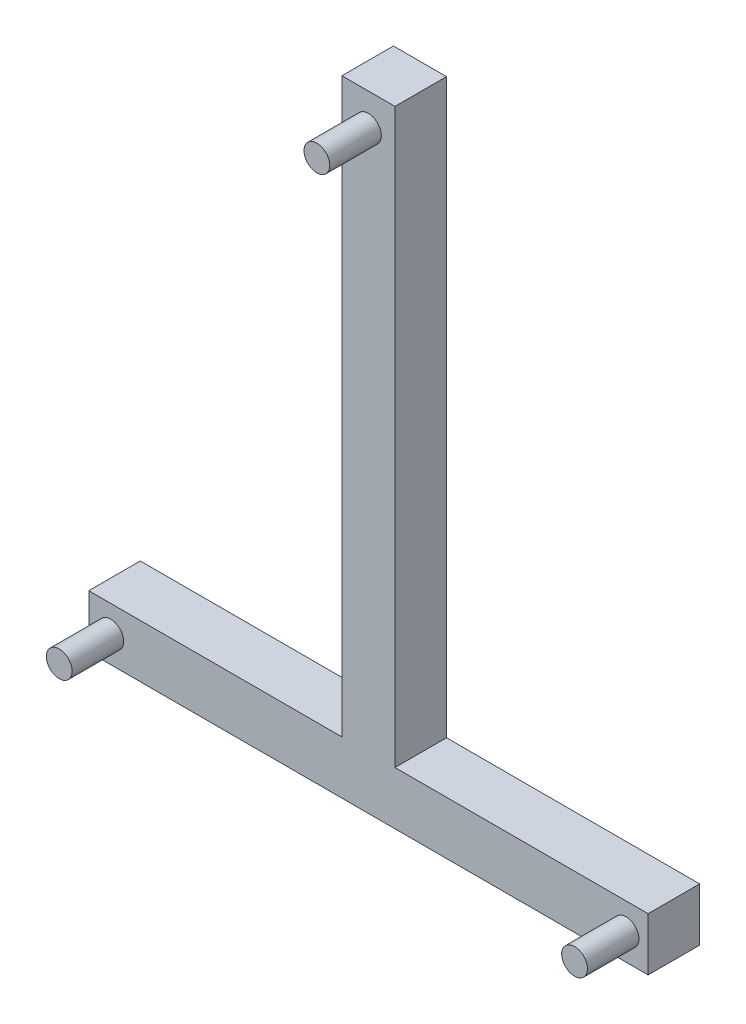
ISO-10303-21;
HEADER;
FILE_DESCRIPTION(('STEP AP214'),'2;1');
FILE_NAME('part.step','',(''),(''),'','','');
FILE_SCHEMA(('AUTOMOTIVE_DESIGN { 1 0 10303 214 1 1 1 1 }'));
ENDSEC;
DATA;
#1=APPLICATION_CONTEXT('core data for automotive mechanical design processes');
#2=APPLICATION_PROTOCOL_DEFINITION('international standard','automotive_design',2000,#1);
#3=PRODUCT_CONTEXT('',#1,'mechanical');
#4=PRODUCT('Part','Part','',(#3));
#5=PRODUCT_RELATED_PRODUCT_CATEGORY('part','',(#4));
#6=PRODUCT_DEFINITION_FORMATION('','',#4);
#7=PRODUCT_DEFINITION_CONTEXT('part definition',#1,'design');
#8=PRODUCT_DEFINITION('design','',#6,#7);
#9=PRODUCT_DEFINITION_SHAPE('','',#8);
#10=(LENGTH_UNIT() NAMED_UNIT(*) SI_UNIT(.MILLI.,.METRE.));
#11=(NAMED_UNIT(*) PLANE_ANGLE_UNIT() SI_UNIT($,.RADIAN.));
#12=(NAMED_UNIT(*) SI_UNIT($,.STERADIAN.) SOLID_ANGLE_UNIT());
#13=UNCERTAINTY_MEASURE_WITH_UNIT(LENGTH_MEASURE(1.E-05),#10,'distance_accuracy_value','');
#14=(GEOMETRIC_REPRESENTATION_CONTEXT(3) GLOBAL_UNCERTAINTY_ASSIGNED_CONTEXT((#13)) GLOBAL_UNIT_ASSIGNED_CONTEXT((#10,
#11,#12)) REPRESENTATION_CONTEXT('',''));
#15=CARTESIAN_POINT('',(0.,0.,0.));
#16=DIRECTION('',(0.,0.,1.));
#17=DIRECTION('',(1.,0.,0.));
#18=AXIS2_PLACEMENT_3D('',#15,#16,#17);
#19=CARTESIAN_POINT('',(13.0781386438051,13.0781386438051,-25.4));
#20=DIRECTION('',(0.,1.,0.));
#21=DIRECTION('',(0.,0.,1.));
#22=AXIS2_PLACEMENT_3D('',#19,#20,#21);
#23=PLANE('',#22);
#24=DIRECTION('',(-1.,0.,0.));
#25=VECTOR('',#24,1.);
#26=CARTESIAN_POINT('',(13.0781386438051,13.0781386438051,0.));
#27=LINE('',#26,#25);
#28=CARTESIAN_POINT('',(137.84334742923,13.0781386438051,0.));
#29=VERTEX_POINT('',#28);
#30=CARTESIAN_POINT('',(13.0781386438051,13.0781386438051,0.));
#31=VERTEX_POINT('',#30);
#32=EDGE_CURVE('E132',#29,#31,#27,.T.);
#33=ORIENTED_EDGE('',*,*,#32,.F.);
#34=DIRECTION('',(0.,0.,1.));
#35=VECTOR('',#34,1.);
#36=CARTESIAN_POINT('',(137.84334742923,13.0781386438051,-25.4));
#37=LINE('',#36,#35);
#38=CARTESIAN_POINT('',(137.84334742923,13.0781386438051,-25.4));
#39=VERTEX_POINT('',#38);
#40=EDGE_CURVE('E11',#39,#29,#37,.T.);
#41=ORIENTED_EDGE('',*,*,#40,.F.);
#42=DIRECTION('',(-1.,0.,0.));
#43=VECTOR('',#42,1.);
#44=CARTESIAN_POINT('',(13.0781386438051,13.0781386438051,-25.4));
#45=LINE('',#44,#43);
#46=CARTESIAN_POINT('',(13.0781386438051,13.0781386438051,-25.4));
#47=VERTEX_POINT('',#46);
#48=EDGE_CURVE('E153',#39,#47,#45,.T.);
#49=ORIENTED_EDGE('',*,*,#48,.T.);
#50=DIRECTION('',(0.,0.,1.));
#51=VECTOR('',#50,1.);
#52=CARTESIAN_POINT('',(13.0781386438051,13.0781386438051,-25.4));
#53=LINE('',#52,#51);
#54=EDGE_CURVE('E38',#47,#31,#53,.T.);
#55=ORIENTED_EDGE('',*,*,#54,.T.);
#56=EDGE_LOOP('',(#33,#41,#49,#55));
#57=FACE_BOUND('',#56,.T.);
#58=ADVANCED_FACE('F35',(#57),#23,.T.);
#59=CARTESIAN_POINT('',(137.84334742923,-13.0781386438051,-25.4));
#60=DIRECTION('',(1.,0.,0.));
#61=DIRECTION('',(0.,0.,-1.));
#62=AXIS2_PLACEMENT_3D('',#59,#60,#61);
#63=PLANE('',#62);
#64=DIRECTION('',(0.,1.,0.));
#65=VECTOR('',#64,1.);
#66=CARTESIAN_POINT('',(137.84334742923,-13.0781386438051,0.));
#67=LINE('',#66,#65);
#68=CARTESIAN_POINT('',(137.84334742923,-13.0781386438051,0.));
#69=VERTEX_POINT('',#68);
#70=EDGE_CURVE('E151',#69,#29,#67,.T.);
#71=ORIENTED_EDGE('',*,*,#70,.F.);
#72=DIRECTION('',(0.,0.,1.));
#73=VECTOR('',#72,1.);
#74=CARTESIAN_POINT('',(137.84334742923,-13.0781386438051,-25.4));
#75=LINE('',#74,#73);
#76=CARTESIAN_POINT('',(137.84334742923,-13.0781386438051,-25.4));
#77=VERTEX_POINT('',#76);
#78=EDGE_CURVE('E44',#77,#69,#75,.T.);
#79=ORIENTED_EDGE('',*,*,#78,.F.);
#80=DIRECTION('',(0.,1.,0.));
#81=VECTOR('',#80,1.);
#82=CARTESIAN_POINT('',(137.84334742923,-13.0781386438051,-25.4));
#83=LINE('',#82,#81);
#84=EDGE_CURVE('E122',#77,#39,#83,.T.);
#85=ORIENTED_EDGE('',*,*,#84,.T.);
#86=ORIENTED_EDGE('',*,*,#40,.T.);
#87=EDGE_LOOP('',(#71,#79,#85,#86));
#88=FACE_BOUND('',#87,.T.);
#89=ADVANCED_FACE('F165',(#88),#63,.T.);
#90=CARTESIAN_POINT('',(-137.84334742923,-13.0781386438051,-25.4));
#91=DIRECTION('',(0.,-1.,0.));
#92=DIRECTION('',(0.,0.,-1.));
#93=AXIS2_PLACEMENT_3D('',#90,#91,#92);
#94=PLANE('',#93);
#95=DIRECTION('',(1.,0.,0.));
#96=VECTOR('',#95,1.);
#97=CARTESIAN_POINT('',(-137.84334742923,-13.0781386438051,0.));
#98=LINE('',#97,#96);
#99=CARTESIAN_POINT('',(-137.84334742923,-13.0781386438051,0.));
#100=VERTEX_POINT('',#99);
#101=EDGE_CURVE('E109',#100,#69,#98,.T.);
#102=ORIENTED_EDGE('',*,*,#101,.F.);
#103=DIRECTION('',(0.,0.,1.));
#104=VECTOR('',#103,1.);
#105=CARTESIAN_POINT('',(-137.84334742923,-13.0781386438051,-25.4));
#106=LINE('',#105,#104);
#107=CARTESIAN_POINT('',(-137.84334742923,-13.0781386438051,-25.4));
#108=VERTEX_POINT('',#107);
#109=EDGE_CURVE('E104',#108,#100,#106,.T.);
#110=ORIENTED_EDGE('',*,*,#109,.F.);
#111=DIRECTION('',(1.,0.,0.));
#112=VECTOR('',#111,1.);
#113=CARTESIAN_POINT('',(-137.84334742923,-13.0781386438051,-25.4));
#114=LINE('',#113,#112);
#115=EDGE_CURVE('E107',#108,#77,#114,.T.);
#116=ORIENTED_EDGE('',*,*,#115,.T.);
#117=ORIENTED_EDGE('',*,*,#78,.T.);
#118=EDGE_LOOP('',(#102,#110,#116,#117));
#119=FACE_BOUND('',#118,.T.);
#120=ADVANCED_FACE('F106',(#119),#94,.T.);
#121=CARTESIAN_POINT('',(-137.84334742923,-13.0781386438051,-25.4));
#122=DIRECTION('',(-1.,0.,0.));
#123=DIRECTION('',(0.,0.,1.));
#124=AXIS2_PLACEMENT_3D('',#121,#122,#123);
#125=PLANE('',#124);
#126=DIRECTION('',(0.,-1.,0.));
#127=VECTOR('',#126,1.);
#128=CARTESIAN_POINT('',(-137.84334742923,-13.0781386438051,0.));
#129=LINE('',#128,#127);
#130=CARTESIAN_POINT('',(-137.84334742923,13.0781386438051,0.));
#131=VERTEX_POINT('',#130);
#132=EDGE_CURVE('E148',#131,#100,#129,.T.);
#133=ORIENTED_EDGE('',*,*,#132,.F.);
#134=DIRECTION('',(0.,0.,1.));
#135=VECTOR('',#134,1.);
#136=CARTESIAN_POINT('',(-137.84334742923,13.0781386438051,-25.4));
#137=LINE('',#136,#135);
#138=CARTESIAN_POINT('',(-137.84334742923,13.0781386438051,-25.4));
#139=VERTEX_POINT('',#138);
#140=EDGE_CURVE('E114',#139,#131,#137,.T.);
#141=ORIENTED_EDGE('',*,*,#140,.F.);
#142=DIRECTION('',(0.,-1.,0.));
#143=VECTOR('',#142,1.);
#144=CARTESIAN_POINT('',(-137.84334742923,-13.0781386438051,-25.4));
#145=LINE('',#144,#143);
#146=EDGE_CURVE('E120',#139,#108,#145,.T.);
#147=ORIENTED_EDGE('',*,*,#146,.T.);
#148=ORIENTED_EDGE('',*,*,#109,.T.);
#149=EDGE_LOOP('',(#133,#141,#147,#148));
#150=FACE_BOUND('',#149,.T.);
#151=ADVANCED_FACE('F124',(#150),#125,.T.);
#152=CARTESIAN_POINT('',(-137.84334742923,13.0781386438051,-25.4));
#153=DIRECTION('',(0.,1.,0.));
#154=DIRECTION('',(0.,0.,1.));
#155=AXIS2_PLACEMENT_3D('',#152,#153,#154);
#156=PLANE('',#155);
#157=DIRECTION('',(-1.,0.,0.));
#158=VECTOR('',#157,1.);
#159=CARTESIAN_POINT('',(-137.84334742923,13.0781386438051,0.));
#160=LINE('',#159,#158);
#161=CARTESIAN_POINT('',(-13.0781386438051,13.0781386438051,0.));
#162=VERTEX_POINT('',#161);
#163=EDGE_CURVE('E145',#162,#131,#160,.T.);
#164=ORIENTED_EDGE('',*,*,#163,.F.);
#165=DIRECTION('',(0.,0.,1.));
#166=VECTOR('',#165,1.);
#167=CARTESIAN_POINT('',(-13.0781386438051,13.0781386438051,-25.4));
#168=LINE('',#167,#166);
#169=CARTESIAN_POINT('',(-13.0781386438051,13.0781386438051,-25.4));
#170=VERTEX_POINT('',#169);
#171=EDGE_CURVE('E157',#170,#162,#168,.T.);
#172=ORIENTED_EDGE('',*,*,#171,.F.);
#173=DIRECTION('',(-1.,0.,0.));
#174=VECTOR('',#173,1.);
#175=CARTESIAN_POINT('',(-137.84334742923,13.0781386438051,-25.4));
#176=LINE('',#175,#174);
#177=EDGE_CURVE('E125',#170,#139,#176,.T.);
#178=ORIENTED_EDGE('',*,*,#177,.T.);
#179=ORIENTED_EDGE('',*,*,#140,.T.);
#180=EDGE_LOOP('',(#164,#172,#178,#179));
#181=FACE_BOUND('',#180,.T.);
#182=ADVANCED_FACE('F178',(#181),#156,.T.);
#183=CARTESIAN_POINT('',(-13.0781386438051,13.0781386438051,-25.4));
#184=DIRECTION('',(-1.,0.,0.));
#185=DIRECTION('',(0.,0.,1.));
#186=AXIS2_PLACEMENT_3D('',#183,#184,#185);
#187=PLANE('',#186);
#188=DIRECTION('',(0.,-1.,0.));
#189=VECTOR('',#188,1.);
#190=CARTESIAN_POINT('',(-13.0781386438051,13.0781386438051,0.));
#191=LINE('',#190,#189);
#192=CARTESIAN_POINT('',(-13.0781386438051,295.274422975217,0.));
#193=VERTEX_POINT('',#192);
#194=EDGE_CURVE('E142',#193,#162,#191,.T.);
#195=ORIENTED_EDGE('',*,*,#194,.F.);
#196=DIRECTION('',(0.,0.,1.));
#197=VECTOR('',#196,1.);
#198=CARTESIAN_POINT('',(-13.0781386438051,295.274422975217,-25.4));
#199=LINE('',#198,#197);
#200=CARTESIAN_POINT('',(-13.0781386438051,295.274422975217,-25.4));
#201=VERTEX_POINT('',#200);
#202=EDGE_CURVE('E159',#201,#193,#199,.T.);
#203=ORIENTED_EDGE('',*,*,#202,.F.);
#204=DIRECTION('',(0.,-1.,0.));
#205=VECTOR('',#204,1.);
#206=CARTESIAN_POINT('',(-13.0781386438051,13.0781386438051,-25.4));
#207=LINE('',#206,#205);
#208=EDGE_CURVE('E127',#201,#170,#207,.T.);
#209=ORIENTED_EDGE('',*,*,#208,.T.);
#210=ORIENTED_EDGE('',*,*,#171,.T.);
#211=EDGE_LOOP('',(#195,#203,#209,#210));
#212=FACE_BOUND('',#211,.T.);
#213=ADVANCED_FACE('F181',(#212),#187,.T.);
#214=CARTESIAN_POINT('',(13.0781386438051,295.274422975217,-25.4));
#215=DIRECTION('',(0.,1.,0.));
#216=DIRECTION('',(0.,0.,1.));
#217=AXIS2_PLACEMENT_3D('',#214,#215,#216);
#218=PLANE('',#217);
#219=DIRECTION('',(-1.,0.,0.));
#220=VECTOR('',#219,1.);
#221=CARTESIAN_POINT('',(13.0781386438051,295.274422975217,0.));
#222=LINE('',#221,#220);
#223=CARTESIAN_POINT('',(13.0781386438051,295.274422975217,0.));
#224=VERTEX_POINT('',#223);
#225=EDGE_CURVE('E139',#224,#193,#222,.T.);
#226=ORIENTED_EDGE('',*,*,#225,.F.);
#227=DIRECTION('',(0.,0.,1.));
#228=VECTOR('',#227,1.);
#229=CARTESIAN_POINT('',(13.0781386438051,295.274422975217,-25.4));
#230=LINE('',#229,#228);
#231=CARTESIAN_POINT('',(13.0781386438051,295.274422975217,-25.4));
#232=VERTEX_POINT('',#231);
#233=EDGE_CURVE('E160',#232,#224,#230,.T.);
#234=ORIENTED_EDGE('',*,*,#233,.F.);
#235=DIRECTION('',(-1.,0.,0.));
#236=VECTOR('',#235,1.);
#237=CARTESIAN_POINT('',(13.0781386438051,295.274422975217,-25.4));
#238=LINE('',#237,#236);
#239=EDGE_CURVE('E247',#232,#201,#238,.T.);
#240=ORIENTED_EDGE('',*,*,#239,.T.);
#241=ORIENTED_EDGE('',*,*,#202,.T.);
#242=EDGE_LOOP('',(#226,#234,#240,#241));
#243=FACE_BOUND('',#242,.T.);
#244=ADVANCED_FACE('F185',(#243),#218,.T.);
#245=CARTESIAN_POINT('',(13.0781386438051,13.0781386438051,-25.4));
#246=DIRECTION('',(1.,0.,0.));
#247=DIRECTION('',(0.,0.,-1.));
#248=AXIS2_PLACEMENT_3D('',#245,#246,#247);
#249=PLANE('',#248);
#250=DIRECTION('',(0.,1.,0.));
#251=VECTOR('',#250,1.);
#252=CARTESIAN_POINT('',(13.0781386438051,13.0781386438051,0.));
#253=LINE('',#252,#251);
#254=EDGE_CURVE('E135',#31,#224,#253,.T.);
#255=ORIENTED_EDGE('',*,*,#254,.F.);
#256=ORIENTED_EDGE('',*,*,#54,.F.);
#257=DIRECTION('',(0.,1.,0.));
#258=VECTOR('',#257,1.);
#259=CARTESIAN_POINT('',(13.0781386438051,13.0781386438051,-25.4));
#260=LINE('',#259,#258);
#261=EDGE_CURVE('E245',#47,#232,#260,.T.);
#262=ORIENTED_EDGE('',*,*,#261,.T.);
#263=ORIENTED_EDGE('',*,*,#233,.T.);
#264=EDGE_LOOP('',(#255,#256,#262,#263));
#265=FACE_BOUND('',#264,.T.);
#266=ADVANCED_FACE('F162',(#265),#249,.T.);
#267=CARTESIAN_POINT('',(0.,0.,-25.4));
#268=DIRECTION('',(0.,0.,1.));
#269=DIRECTION('',(1.,0.,0.));
#270=AXIS2_PLACEMENT_3D('',#267,#268,#269);
#271=PLANE('',#270);
#272=ORIENTED_EDGE('',*,*,#48,.F.);
#273=ORIENTED_EDGE('',*,*,#84,.F.);
#274=ORIENTED_EDGE('',*,*,#115,.F.);
#275=ORIENTED_EDGE('',*,*,#146,.F.);
#276=ORIENTED_EDGE('',*,*,#177,.F.);
#277=ORIENTED_EDGE('',*,*,#208,.F.);
#278=ORIENTED_EDGE('',*,*,#239,.F.);
#279=ORIENTED_EDGE('',*,*,#261,.F.);
#280=EDGE_LOOP('',(#272,#273,#274,#275,#276,#277,#278,#279));
#281=FACE_BOUND('',#280,.T.);
#282=ADVANCED_FACE('F118',(#281),#271,.F.);
#283=CARTESIAN_POINT('',(0.,0.,0.));
#284=DIRECTION('',(0.,0.,1.));
#285=DIRECTION('',(1.,0.,0.));
#286=AXIS2_PLACEMENT_3D('',#283,#284,#285);
#287=PLANE('',#286);
#288=CARTESIAN_POINT('',(0.,279.4,0.));
#289=DIRECTION('',(0.,0.,1.));
#290=DIRECTION('',(1.,0.,0.));
#291=AXIS2_PLACEMENT_3D('',#288,#289,#290);
#292=CIRCLE('',#291,6.35);
#293=CARTESIAN_POINT('',(6.35,279.4,0.));
#294=VERTEX_POINT('',#293);
#295=EDGE_CURVE('E238',#294,#294,#292,.T.);
#296=ORIENTED_EDGE('',*,*,#295,.F.);
#297=EDGE_LOOP('',(#296));
#298=FACE_BOUND('',#297,.T.);
#299=CARTESIAN_POINT('',(127.,0.,0.));
#300=DIRECTION('',(0.,0.,1.));
#301=DIRECTION('',(1.,0.,0.));
#302=AXIS2_PLACEMENT_3D('',#299,#300,#301);
#303=CIRCLE('',#302,6.35);
#304=CARTESIAN_POINT('',(133.35,0.,0.));
#305=VERTEX_POINT('',#304);
#306=EDGE_CURVE('E226',#305,#305,#303,.T.);
#307=ORIENTED_EDGE('',*,*,#306,.F.);
#308=EDGE_LOOP('',(#307));
#309=FACE_BOUND('',#308,.T.);
#310=CARTESIAN_POINT('',(-127.,0.,0.));
#311=DIRECTION('',(0.,0.,1.));
#312=DIRECTION('',(1.,0.,0.));
#313=AXIS2_PLACEMENT_3D('',#310,#311,#312);
#314=CIRCLE('',#313,6.35000000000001);
#315=CARTESIAN_POINT('',(-120.65,0.,0.));
#316=VERTEX_POINT('',#315);
#317=EDGE_CURVE('E136',#316,#316,#314,.T.);
#318=ORIENTED_EDGE('',*,*,#317,.F.);
#319=EDGE_LOOP('',(#318));
#320=FACE_BOUND('',#319,.T.);
#321=ORIENTED_EDGE('',*,*,#32,.T.);
#322=ORIENTED_EDGE('',*,*,#254,.T.);
#323=ORIENTED_EDGE('',*,*,#225,.T.);
#324=ORIENTED_EDGE('',*,*,#194,.T.);
#325=ORIENTED_EDGE('',*,*,#163,.T.);
#326=ORIENTED_EDGE('',*,*,#132,.T.);
#327=ORIENTED_EDGE('',*,*,#101,.T.);
#328=ORIENTED_EDGE('',*,*,#70,.T.);
#329=EDGE_LOOP('',(#321,#322,#323,#324,#325,#326,#327,#328));
#330=FACE_BOUND('',#329,.T.);
#331=ADVANCED_FACE('F164',(#298,#309,#320,#330),#287,.T.);
#332=CARTESIAN_POINT('',(0.,279.4,25.4));
#333=DIRECTION('',(0.,0.,-1.));
#334=DIRECTION('',(-1.,0.,0.));
#335=AXIS2_PLACEMENT_3D('',#332,#333,#334);
#336=CYLINDRICAL_SURFACE('',#335,6.35);
#337=ORIENTED_EDGE('',*,*,#295,.T.);
#338=EDGE_LOOP('',(#337));
#339=FACE_BOUND('',#338,.T.);
#340=CARTESIAN_POINT('',(0.,279.4,25.4));
#341=DIRECTION('',(0.,0.,1.));
#342=DIRECTION('',(1.,0.,0.));
#343=AXIS2_PLACEMENT_3D('',#340,#341,#342);
#344=CIRCLE('',#343,6.35);
#345=CARTESIAN_POINT('',(6.35,279.4,25.4));
#346=VERTEX_POINT('',#345);
#347=EDGE_CURVE('E233',#346,#346,#344,.T.);
#348=ORIENTED_EDGE('',*,*,#347,.F.);
#349=EDGE_LOOP('',(#348));
#350=FACE_BOUND('',#349,.T.);
#351=ADVANCED_FACE('F196',(#339,#350),#336,.T.);
#352=CARTESIAN_POINT('',(0.,0.,25.4));
#353=DIRECTION('',(0.,0.,1.));
#354=DIRECTION('',(1.,0.,0.));
#355=AXIS2_PLACEMENT_3D('',#352,#353,#354);
#356=PLANE('',#355);
#357=ORIENTED_EDGE('',*,*,#347,.T.);
#358=EDGE_LOOP('',(#357));
#359=FACE_BOUND('',#358,.T.);
#360=ADVANCED_FACE('F201',(#359),#356,.T.);
#361=CARTESIAN_POINT('',(-127.,0.,25.4));
#362=DIRECTION('',(0.,0.,-1.));
#363=DIRECTION('',(-1.,0.,0.));
#364=AXIS2_PLACEMENT_3D('',#361,#362,#363);
#365=CYLINDRICAL_SURFACE('',#364,6.35000000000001);
#366=ORIENTED_EDGE('',*,*,#317,.T.);
#367=EDGE_LOOP('',(#366));
#368=FACE_BOUND('',#367,.T.);
#369=CARTESIAN_POINT('',(-127.,0.,25.4));
#370=DIRECTION('',(0.,0.,1.));
#371=DIRECTION('',(1.,0.,0.));
#372=AXIS2_PLACEMENT_3D('',#369,#370,#371);
#373=CIRCLE('',#372,6.35000000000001);
#374=CARTESIAN_POINT('',(-120.65,0.,25.4));
#375=VERTEX_POINT('',#374);
#376=EDGE_CURVE('E230',#375,#375,#373,.T.);
#377=ORIENTED_EDGE('',*,*,#376,.F.);
#378=EDGE_LOOP('',(#377));
#379=FACE_BOUND('',#378,.T.);
#380=ADVANCED_FACE('F205',(#368,#379),#365,.T.);
#381=CARTESIAN_POINT('',(-127.,0.,25.4));
#382=DIRECTION('',(0.,0.,1.));
#383=DIRECTION('',(1.,0.,0.));
#384=AXIS2_PLACEMENT_3D('',#381,#382,#383);
#385=PLANE('',#384);
#386=ORIENTED_EDGE('',*,*,#376,.T.);
#387=EDGE_LOOP('',(#386));
#388=FACE_BOUND('',#387,.T.);
#389=ADVANCED_FACE('F207',(#388),#385,.T.);
#390=CARTESIAN_POINT('',(127.,0.,25.4));
#391=DIRECTION('',(0.,0.,-1.));
#392=DIRECTION('',(-1.,0.,0.));
#393=AXIS2_PLACEMENT_3D('',#390,#391,#392);
#394=CYLINDRICAL_SURFACE('',#393,6.35);
#395=ORIENTED_EDGE('',*,*,#306,.T.);
#396=EDGE_LOOP('',(#395));
#397=FACE_BOUND('',#396,.T.);
#398=CARTESIAN_POINT('',(127.,0.,25.4));
#399=DIRECTION('',(0.,0.,1.));
#400=DIRECTION('',(1.,0.,0.));
#401=AXIS2_PLACEMENT_3D('',#398,#399,#400);
#402=CIRCLE('',#401,6.35);
#403=CARTESIAN_POINT('',(133.35,0.,25.4));
#404=VERTEX_POINT('',#403);
#405=EDGE_CURVE('E229',#404,#404,#402,.T.);
#406=ORIENTED_EDGE('',*,*,#405,.F.);
#407=EDGE_LOOP('',(#406));
#408=FACE_BOUND('',#407,.T.);
#409=ADVANCED_FACE('F210',(#397,#408),#394,.T.);
#410=CARTESIAN_POINT('',(127.,0.,25.4));
#411=DIRECTION('',(0.,0.,1.));
#412=DIRECTION('',(1.,0.,0.));
#413=AXIS2_PLACEMENT_3D('',#410,#411,#412);
#414=PLANE('',#413);
#415=ORIENTED_EDGE('',*,*,#405,.T.);
#416=EDGE_LOOP('',(#415));
#417=FACE_BOUND('',#416,.T.);
#418=ADVANCED_FACE('F215',(#417),#414,.T.);
#419=CLOSED_SHELL('',(#58,#89,#120,#151,#182,#213,#244,#266,#282,#331,#351,#360,#380,#389,#409,#418));
#420=MANIFOLD_SOLID_BREP('B2',#419);
#421=ADVANCED_BREP_SHAPE_REPRESENTATION('',(#18,#420),#14);
#422=SHAPE_DEFINITION_REPRESENTATION(#9,#421);
ENDSEC;
END-ISO-10303-21;
